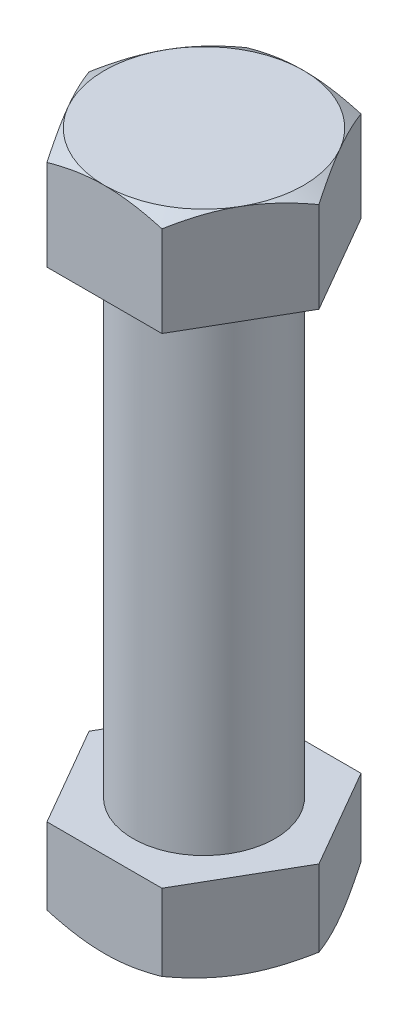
ISO-10303-21;
HEADER;
FILE_DESCRIPTION(('STEP AP214'),'2;1');
FILE_NAME('part.step','',(''),(''),'','','');
FILE_SCHEMA(('AUTOMOTIVE_DESIGN { 1 0 10303 214 1 1 1 1 }'));
ENDSEC;
DATA;
#1=APPLICATION_CONTEXT('core data for automotive mechanical design processes');
#2=APPLICATION_PROTOCOL_DEFINITION('international standard','automotive_design',2000,#1);
#3=PRODUCT_CONTEXT('',#1,'mechanical');
#4=PRODUCT('Part','Part','',(#3));
#5=PRODUCT_RELATED_PRODUCT_CATEGORY('part','',(#4));
#6=PRODUCT_DEFINITION_FORMATION('','',#4);
#7=PRODUCT_DEFINITION_CONTEXT('part definition',#1,'design');
#8=PRODUCT_DEFINITION('design','',#6,#7);
#9=PRODUCT_DEFINITION_SHAPE('','',#8);
#10=(LENGTH_UNIT() NAMED_UNIT(*) SI_UNIT(.MILLI.,.METRE.));
#11=(NAMED_UNIT(*) PLANE_ANGLE_UNIT() SI_UNIT($,.RADIAN.));
#12=(NAMED_UNIT(*) SI_UNIT($,.STERADIAN.) SOLID_ANGLE_UNIT());
#13=UNCERTAINTY_MEASURE_WITH_UNIT(LENGTH_MEASURE(1.E-05),#10,'distance_accuracy_value','');
#14=(GEOMETRIC_REPRESENTATION_CONTEXT(3) GLOBAL_UNCERTAINTY_ASSIGNED_CONTEXT((#13)) GLOBAL_UNIT_ASSIGNED_CONTEXT((#10,
#11,#12)) REPRESENTATION_CONTEXT('',''));
#15=CARTESIAN_POINT('',(0.,0.,0.));
#16=DIRECTION('',(0.,0.,1.));
#17=DIRECTION('',(1.,0.,0.));
#18=AXIS2_PLACEMENT_3D('',#15,#16,#17);
#19=CARTESIAN_POINT('',(-12.7,42.9,0.));
#20=DIRECTION('',(0.,-1.,0.));
#21=DIRECTION('',(0.,0.,1.));
#22=AXIS2_PLACEMENT_3D('',#19,#20,#21);
#23=PLANE('',#22);
#24=CARTESIAN_POINT('',(0.,42.9,0.));
#25=DIRECTION('',(0.,-1.,0.));
#26=DIRECTION('',(0.,0.,1.));
#27=AXIS2_PLACEMENT_3D('',#24,#25,#26);
#28=CIRCLE('',#27,12.7);
#29=CARTESIAN_POINT('',(0.,42.9,12.7));
#30=VERTEX_POINT('',#29);
#31=EDGE_CURVE('E360',#30,#30,#28,.T.);
#32=ORIENTED_EDGE('',*,*,#31,.F.);
#33=EDGE_LOOP('',(#32));
#34=FACE_BOUND('',#33,.T.);
#35=DIRECTION('',(-0.5,0.,-0.866025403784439));
#36=VECTOR('',#35,1.);
#37=CARTESIAN_POINT('',(-20.5305755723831,42.9,0.));
#38=LINE('',#37,#36);
#39=CARTESIAN_POINT('',(-10.2652877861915,42.9,17.78));
#40=VERTEX_POINT('',#39);
#41=CARTESIAN_POINT('',(-20.5305755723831,42.9,0.));
#42=VERTEX_POINT('',#41);
#43=EDGE_CURVE('E363',#40,#42,#38,.T.);
#44=ORIENTED_EDGE('',*,*,#43,.T.);
#45=DIRECTION('',(0.5,0.,-0.866025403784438));
#46=VECTOR('',#45,1.);
#47=CARTESIAN_POINT('',(-10.2652877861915,42.9,-17.78));
#48=LINE('',#47,#46);
#49=CARTESIAN_POINT('',(-10.2652877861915,42.9,-17.78));
#50=VERTEX_POINT('',#49);
#51=EDGE_CURVE('E179',#42,#50,#48,.T.);
#52=ORIENTED_EDGE('',*,*,#51,.T.);
#53=DIRECTION('',(1.,0.,0.));
#54=VECTOR('',#53,1.);
#55=CARTESIAN_POINT('',(10.2652877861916,42.9,-17.78));
#56=LINE('',#55,#54);
#57=CARTESIAN_POINT('',(10.2652877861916,42.9,-17.78));
#58=VERTEX_POINT('',#57);
#59=EDGE_CURVE('E174',#50,#58,#56,.T.);
#60=ORIENTED_EDGE('',*,*,#59,.T.);
#61=DIRECTION('',(0.5,0.,0.866025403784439));
#62=VECTOR('',#61,1.);
#63=CARTESIAN_POINT('',(20.5305755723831,42.9,0.));
#64=LINE('',#63,#62);
#65=CARTESIAN_POINT('',(20.5305755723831,42.9,0.));
#66=VERTEX_POINT('',#65);
#67=EDGE_CURVE('E191',#58,#66,#64,.T.);
#68=ORIENTED_EDGE('',*,*,#67,.T.);
#69=DIRECTION('',(-0.5,0.,0.866025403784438));
#70=VECTOR('',#69,1.);
#71=CARTESIAN_POINT('',(10.2652877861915,42.9,17.78));
#72=LINE('',#71,#70);
#73=CARTESIAN_POINT('',(10.2652877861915,42.9,17.78));
#74=VERTEX_POINT('',#73);
#75=EDGE_CURVE('E375',#66,#74,#72,.T.);
#76=ORIENTED_EDGE('',*,*,#75,.T.);
#77=DIRECTION('',(-1.,0.,0.));
#78=VECTOR('',#77,1.);
#79=CARTESIAN_POINT('',(-10.2652877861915,42.9,17.78));
#80=LINE('',#79,#78);
#81=EDGE_CURVE('E365',#74,#40,#80,.T.);
#82=ORIENTED_EDGE('',*,*,#81,.T.);
#83=EDGE_LOOP('',(#44,#52,#60,#68,#76,#82));
#84=FACE_BOUND('',#83,.T.);
#85=ADVANCED_FACE('F40',(#34,#84),#23,.T.);
#86=CARTESIAN_POINT('',(0.,59.0888803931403,0.));
#87=DIRECTION('',(0.,-1.,0.));
#88=DIRECTION('',(0.,0.,1.));
#89=AXIS2_PLACEMENT_3D('',#86,#87,#88);
#90=CONICAL_SURFACE('',#89,20.5359,1.0471975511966);
#91=CARTESIAN_POINT('',(27.2254823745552,52.1715890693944,-17.78));
#92=CARTESIAN_POINT('',(26.8351739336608,52.3602592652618,-17.78));
#93=CARTESIAN_POINT('',(26.444393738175,52.5479530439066,-17.78));
#94=CARTESIAN_POINT('',(25.6617901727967,52.921163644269,-17.78));
#95=CARTESIAN_POINT('',(25.2699667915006,53.1066804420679,-17.78));
#96=CARTESIAN_POINT('',(24.0926676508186,53.6596829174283,-17.78));
#97=CARTESIAN_POINT('',(23.3054897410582,54.023559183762,-17.78));
#98=CARTESIAN_POINT('',(21.7211901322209,54.7414195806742,-17.78));
#99=CARTESIAN_POINT('',(20.9240373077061,55.0953351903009,-17.78));
#100=CARTESIAN_POINT('',(19.323180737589,55.787971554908,-17.78));
#101=CARTESIAN_POINT('',(18.5194773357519,56.1266931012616,-17.78));
#102=CARTESIAN_POINT('',(16.8942623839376,56.7889133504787,-17.78));
#103=CARTESIAN_POINT('',(16.0726533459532,57.1121740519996,-17.78));
#104=CARTESIAN_POINT('',(14.4197388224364,57.7333799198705,-17.78));
#105=CARTESIAN_POINT('',(13.5884322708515,58.031322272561,-17.78));
#106=CARTESIAN_POINT('',(11.9165348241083,58.5938821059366,-17.78));
#107=CARTESIAN_POINT('',(11.075967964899,58.8585704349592,-17.78));
#108=CARTESIAN_POINT('',(9.38280321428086,59.3460394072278,-17.78));
#109=CARTESIAN_POINT('',(8.53020921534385,59.5688332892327,-17.78));
#110=CARTESIAN_POINT('',(7.24213587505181,59.8634476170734,-17.78));
#111=CARTESIAN_POINT('',(6.81115635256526,59.9550713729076,-17.78));
#112=CARTESIAN_POINT('',(5.94632881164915,60.1236799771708,-17.78));
#113=CARTESIAN_POINT('',(5.5124808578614,60.2006651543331,-17.78));
#114=CARTESIAN_POINT('',(4.64220759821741,60.3386317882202,-17.78));
#115=CARTESIAN_POINT('',(4.20578213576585,60.3996122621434,-17.78));
#116=CARTESIAN_POINT('',(3.33085390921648,60.5043446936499,-17.78));
#117=CARTESIAN_POINT('',(2.89235114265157,60.5480966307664,-17.78));
#118=CARTESIAN_POINT('',(2.01669172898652,60.6171941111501,-17.78));
#119=CARTESIAN_POINT('',(1.57954423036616,60.6426548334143,-17.78));
#120=CARTESIAN_POINT('',(0.704565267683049,60.6750360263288,-17.78));
#121=CARTESIAN_POINT('',(0.266733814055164,60.6819567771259,-17.78));
#122=CARTESIAN_POINT('',(-0.608706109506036,60.6770938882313,-17.78));
#123=CARTESIAN_POINT('',(-1.04631460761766,60.6653154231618,-17.78));
#124=CARTESIAN_POINT('',(-1.92064975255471,60.6233469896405,-17.78));
#125=CARTESIAN_POINT('',(-2.35737635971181,60.5931562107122,-17.78));
#126=CARTESIAN_POINT('',(-3.4155339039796,60.4983291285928,-17.78));
#127=CARTESIAN_POINT('',(-4.03615593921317,60.4244869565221,-17.78));
#128=CARTESIAN_POINT('',(-5.27253843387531,60.2437309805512,-17.78));
#129=CARTESIAN_POINT('',(-5.88829815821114,60.1368122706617,-17.78));
#130=CARTESIAN_POINT('',(-7.72935796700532,59.7718040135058,-17.78));
#131=CARTESIAN_POINT('',(-8.94603372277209,59.4697053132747,-17.78));
#132=CARTESIAN_POINT('',(-10.7659782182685,58.9487834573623,-17.78));
#133=CARTESIAN_POINT('',(-11.3787556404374,58.7612979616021,-17.78));
#134=CARTESIAN_POINT('',(-12.5983904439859,58.3676329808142,-17.78));
#135=CARTESIAN_POINT('',(-13.2052472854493,58.161451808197,-17.78));
#136=CARTESIAN_POINT('',(-14.410015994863,57.7347887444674,-17.78));
#137=CARTESIAN_POINT('',(-15.0079590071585,57.5143940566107,-17.78));
#138=CARTESIAN_POINT('',(-15.9011075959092,57.1742594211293,-17.78));
#139=CARTESIAN_POINT('',(-16.1981481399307,57.059310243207,-17.78));
#140=CARTESIAN_POINT('',(-16.7910752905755,56.8264891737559,-17.78));
#141=CARTESIAN_POINT('',(-17.0869619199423,56.7086173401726,-17.78));
#142=CARTESIAN_POINT('',(-17.382311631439,56.5894160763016,-17.78));
#143=B_SPLINE_CURVE_WITH_KNOTS('',3,(#91,#92,#93,#94,#95,#96,#97,#98,#99,#100,#101,#102,#103,
#104,#105,#106,#107,#108,#109,#110,#111,#112,#113,#114,#115,#116,#117,#118,#119,#120,#121,#122,
#123,#124,#125,#126,#127,#128,#129,#130,#131,#132,#133,#134,#135,#136,#137,#138,#139,#140,#141,
#142),.UNSPECIFIED.,.F.,.F.,(4,2,2,2,2,2,2,2,2,2,2,2,2,2,2,2,2,2,2,2,2,2,2,2,2,4),(0.,
1.30054892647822,2.6011121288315,5.20266140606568,7.81909755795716,10.43539727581,
13.0838236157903,15.732543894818,18.3755217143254,21.0176629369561,22.3392880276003,
23.6608834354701,24.9825599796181,26.3042380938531,27.6175189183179,28.930779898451,
30.2436775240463,31.5566329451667,33.4305669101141,35.3047789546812,39.0604224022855,
40.9827238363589,42.9051989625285,44.8168326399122,45.7723387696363,46.7278259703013),.UNSPECIFIED.);
#144=CARTESIAN_POINT('',(0.,60.68,-17.78));
#145=VERTEX_POINT('',#144);
#146=CARTESIAN_POINT('',(-10.2652877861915,59.0919544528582,-17.78));
#147=VERTEX_POINT('',#146);
#148=EDGE_CURVE('E171',#145,#147,#143,.T.);
#149=ORIENTED_EDGE('',*,*,#148,.T.);
#150=CARTESIAN_POINT('',(-10.265286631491,59.0919537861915,-17.780002));
#151=CARTESIAN_POINT('',(-10.4909124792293,59.2222078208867,-17.3892065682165));
#152=CARTESIAN_POINT('',(-10.7174183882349,59.3465509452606,-16.9968868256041));
#153=CARTESIAN_POINT('',(-11.1722465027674,59.5817723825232,-16.2091014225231));
#154=CARTESIAN_POINT('',(-11.4005692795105,59.6926462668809,-15.8136347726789));
#155=CARTESIAN_POINT('',(-11.859472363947,59.8994388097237,-15.0187913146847));
#156=CARTESIAN_POINT('',(-12.0900566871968,59.9953220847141,-14.6194075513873));
#157=CARTESIAN_POINT('',(-12.5528275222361,60.1700744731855,-13.8178649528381));
#158=CARTESIAN_POINT('',(-12.7850139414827,60.248944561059,-13.4157062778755));
#159=CARTESIAN_POINT('',(-13.2450396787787,60.3863160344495,-12.6189183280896));
#160=CARTESIAN_POINT('',(-13.4728448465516,60.4452721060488,-12.22434820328));
#161=CARTESIAN_POINT('',(-13.9294989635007,60.5441272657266,-11.4334000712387));
#162=CARTESIAN_POINT('',(-14.1583479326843,60.5840259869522,-11.0370220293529));
#163=CARTESIAN_POINT('',(-14.616430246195,60.6437590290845,-10.2436001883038));
#164=CARTESIAN_POINT('',(-14.8456628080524,60.6636171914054,-9.84655774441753));
#165=CARTESIAN_POINT('',(-15.3043394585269,60.6828420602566,-9.05210648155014));
#166=CARTESIAN_POINT('',(-15.5337835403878,60.6822094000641,-8.65469767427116));
#167=CARTESIAN_POINT('',(-15.9627271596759,60.6618844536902,-7.91174553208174));
#168=CARTESIAN_POINT('',(-16.162257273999,60.6446706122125,-7.56614923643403));
#169=CARTESIAN_POINT('',(-16.5608415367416,60.5950732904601,-6.87578104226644));
#170=CARTESIAN_POINT('',(-16.7598956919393,60.5626900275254,-6.5310091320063));
#171=CARTESIAN_POINT('',(-17.1574526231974,60.4833157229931,-5.84242032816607));
#172=CARTESIAN_POINT('',(-17.3559547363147,60.4363114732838,-5.49860458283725));
#173=CARTESIAN_POINT('',(-17.7520140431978,60.3285245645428,-4.81260974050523));
#174=CARTESIAN_POINT('',(-17.9495712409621,60.2677419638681,-4.47043063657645));
#175=CARTESIAN_POINT('',(-18.5492811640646,60.0631808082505,-3.43170257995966));
#176=CARTESIAN_POINT('',(-18.9496972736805,59.8990056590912,-2.73816153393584));
#177=CARTESIAN_POINT('',(-19.744559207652,59.5263964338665,-1.36142027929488));
#178=CARTESIAN_POINT('',(-20.1390152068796,59.3180498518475,-0.678202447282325));
#179=CARTESIAN_POINT('',(-20.5305767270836,59.0919537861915,1.99999999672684E-06));
#180=B_SPLINE_CURVE_WITH_KNOTS('',3,(#150,#151,#152,#153,#154,#155,#156,#157,#158,#159,#160,
#161,#162,#163,#164,#165,#166,#167,#168,#169,#170,#171,#172,#173,#174,#175,#176,#177,#178,#179),
.UNSPECIFIED.,.F.,.F.,(4,2,2,2,2,2,2,2,2,2,2,2,2,2,4),(0.,1.4090605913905,2.81858321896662,
4.23138419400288,5.6441042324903,7.02195607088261,8.39983443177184,9.77607164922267,
11.15226633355,12.3502714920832,13.5482594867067,14.7473328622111,15.9464011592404,
18.3973523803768,20.8434934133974),.UNSPECIFIED.);
#181=CARTESIAN_POINT('',(-15.3979316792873,60.68,-8.89));
#182=VERTEX_POINT('',#181);
#183=EDGE_CURVE('E182',#147,#182,#180,.T.);
#184=ORIENTED_EDGE('',*,*,#183,.T.);
#185=CARTESIAN_POINT('',(0.,60.68,0.));
#186=DIRECTION('',(0.,-1.,0.));
#187=DIRECTION('',(0.,0.,1.));
#188=AXIS2_PLACEMENT_3D('',#185,#186,#187);
#189=CIRCLE('',#188,17.78);
#190=EDGE_CURVE('E194',#182,#145,#189,.T.);
#191=ORIENTED_EDGE('',*,*,#190,.T.);
#192=EDGE_LOOP('',(#149,#184,#191));
#193=FACE_BOUND('',#192,.T.);
#194=ADVANCED_FACE('F193',(#193),#90,.T.);
#195=CARTESIAN_POINT('',(-15.3979316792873,60.68,8.89));
#196=VERTEX_POINT('',#195);
#197=EDGE_CURVE('E406',#196,#182,#189,.T.);
#198=ORIENTED_EDGE('',*,*,#197,.T.);
#199=CARTESIAN_POINT('',(-20.5305755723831,59.0919544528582,0.));
#200=VERTEX_POINT('',#199);
#201=EDGE_CURVE('E186',#182,#200,#180,.T.);
#202=ORIENTED_EDGE('',*,*,#201,.T.);
#203=CARTESIAN_POINT('',(-20.5305767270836,59.0919537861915,-2.00000000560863E-06));
#204=CARTESIAN_POINT('',(-20.3049508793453,59.2222078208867,0.390793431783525));
#205=CARTESIAN_POINT('',(-20.0784449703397,59.3465509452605,0.783113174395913));
#206=CARTESIAN_POINT('',(-19.6236168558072,59.5817723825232,1.57089857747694));
#207=CARTESIAN_POINT('',(-19.3952940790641,59.6926462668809,1.96636522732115));
#208=CARTESIAN_POINT('',(-18.9363909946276,59.8994388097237,2.76120868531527));
#209=CARTESIAN_POINT('',(-18.7058066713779,59.9953220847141,3.1605924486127));
#210=CARTESIAN_POINT('',(-18.2430358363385,60.1700744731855,3.96213504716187));
#211=CARTESIAN_POINT('',(-18.0108494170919,60.248944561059,4.36429372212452));
#212=CARTESIAN_POINT('',(-17.550823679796,60.3863160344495,5.16108167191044));
#213=CARTESIAN_POINT('',(-17.323018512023,60.4452721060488,5.55565179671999));
#214=CARTESIAN_POINT('',(-16.8663643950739,60.5441272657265,6.34659992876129));
#215=CARTESIAN_POINT('',(-16.6375154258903,60.5840259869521,6.74297797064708));
#216=CARTESIAN_POINT('',(-16.1794331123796,60.6437590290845,7.53639981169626));
#217=CARTESIAN_POINT('',(-15.9502005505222,60.6636171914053,7.93344225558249));
#218=CARTESIAN_POINT('',(-15.4915239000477,60.6828420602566,8.72789351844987));
#219=CARTESIAN_POINT('',(-15.2620798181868,60.6822094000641,9.12530232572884));
#220=CARTESIAN_POINT('',(-14.8331361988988,60.6618844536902,9.86825446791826));
#221=CARTESIAN_POINT('',(-14.6336060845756,60.6446706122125,10.213850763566));
#222=CARTESIAN_POINT('',(-14.235021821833,60.5950732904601,10.9042189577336));
#223=CARTESIAN_POINT('',(-14.0359676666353,60.5626900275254,11.2489908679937));
#224=CARTESIAN_POINT('',(-13.6384107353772,60.4833157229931,11.9375796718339));
#225=CARTESIAN_POINT('',(-13.43990862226,60.4363114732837,12.2813954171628));
#226=CARTESIAN_POINT('',(-13.0438493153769,60.3285245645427,12.9673902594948));
#227=CARTESIAN_POINT('',(-12.8462921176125,60.2677419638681,13.3095693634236));
#228=CARTESIAN_POINT('',(-12.24658219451,60.0631808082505,14.3482974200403));
#229=CARTESIAN_POINT('',(-11.8461660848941,59.8990056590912,15.0418384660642));
#230=CARTESIAN_POINT('',(-11.0513041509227,59.5263964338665,16.4185797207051));
#231=CARTESIAN_POINT('',(-10.6568481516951,59.3180498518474,17.1017975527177));
#232=CARTESIAN_POINT('',(-10.265286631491,59.0919537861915,17.780002));
#233=B_SPLINE_CURVE_WITH_KNOTS('',3,(#203,#204,#205,#206,#207,#208,#209,#210,#211,#212,#213,
#214,#215,#216,#217,#218,#219,#220,#221,#222,#223,#224,#225,#226,#227,#228,#229,#230,#231,#232),
.UNSPECIFIED.,.F.,.F.,(4,2,2,2,2,2,2,2,2,2,2,2,2,2,4),(0.,1.4090605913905,2.81858321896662,
4.23138419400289,5.64410423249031,7.02195607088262,8.39983443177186,9.77607164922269,
11.15226633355,12.3502714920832,13.5482594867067,14.7473328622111,15.9464011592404,
18.3973523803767,20.8434934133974),.UNSPECIFIED.);
#234=EDGE_CURVE('E259',#200,#196,#233,.T.);
#235=ORIENTED_EDGE('',*,*,#234,.T.);
#236=EDGE_LOOP('',(#198,#202,#235));
#237=FACE_BOUND('',#236,.T.);
#238=ADVANCED_FACE('F221',(#237),#90,.T.);
#239=CARTESIAN_POINT('',(0.,60.68,17.78));
#240=VERTEX_POINT('',#239);
#241=EDGE_CURVE('E401',#240,#196,#189,.T.);
#242=ORIENTED_EDGE('',*,*,#241,.T.);
#243=CARTESIAN_POINT('',(-10.2652877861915,59.0919544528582,17.78));
#244=VERTEX_POINT('',#243);
#245=EDGE_CURVE('E251',#196,#244,#233,.T.);
#246=ORIENTED_EDGE('',*,*,#245,.T.);
#247=CARTESIAN_POINT('',(27.2254823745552,52.1715890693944,17.78));
#248=CARTESIAN_POINT('',(26.8351739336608,52.3602592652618,17.78));
#249=CARTESIAN_POINT('',(26.444393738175,52.5479530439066,17.78));
#250=CARTESIAN_POINT('',(25.6617901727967,52.921163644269,17.78));
#251=CARTESIAN_POINT('',(25.2699667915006,53.1066804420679,17.78));
#252=CARTESIAN_POINT('',(24.0926676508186,53.6596829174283,17.78));
#253=CARTESIAN_POINT('',(23.3054897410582,54.023559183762,17.78));
#254=CARTESIAN_POINT('',(21.7211901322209,54.7414195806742,17.78));
#255=CARTESIAN_POINT('',(20.9240373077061,55.0953351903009,17.78));
#256=CARTESIAN_POINT('',(19.323180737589,55.787971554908,17.78));
#257=CARTESIAN_POINT('',(18.5194773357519,56.1266931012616,17.78));
#258=CARTESIAN_POINT('',(16.8942623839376,56.7889133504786,17.78));
#259=CARTESIAN_POINT('',(16.0726533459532,57.1121740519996,17.78));
#260=CARTESIAN_POINT('',(14.4197388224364,57.7333799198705,17.78));
#261=CARTESIAN_POINT('',(13.5884322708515,58.031322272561,17.78));
#262=CARTESIAN_POINT('',(11.9165348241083,58.5938821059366,17.78));
#263=CARTESIAN_POINT('',(11.075967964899,58.8585704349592,17.78));
#264=CARTESIAN_POINT('',(9.38280321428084,59.3460394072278,17.78));
#265=CARTESIAN_POINT('',(8.53020921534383,59.5688332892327,17.78));
#266=CARTESIAN_POINT('',(7.24213587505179,59.8634476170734,17.78));
#267=CARTESIAN_POINT('',(6.81115635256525,59.9550713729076,17.78));
#268=CARTESIAN_POINT('',(5.94632881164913,60.1236799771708,17.78));
#269=CARTESIAN_POINT('',(5.51248085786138,60.2006651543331,17.78));
#270=CARTESIAN_POINT('',(4.64220759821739,60.3386317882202,17.78));
#271=CARTESIAN_POINT('',(4.20578213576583,60.3996122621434,17.78));
#272=CARTESIAN_POINT('',(3.33085390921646,60.5043446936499,17.78));
#273=CARTESIAN_POINT('',(2.89235114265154,60.5480966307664,17.78));
#274=CARTESIAN_POINT('',(2.0166917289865,60.6171941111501,17.78));
#275=CARTESIAN_POINT('',(1.57954423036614,60.6426548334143,17.78));
#276=CARTESIAN_POINT('',(0.704565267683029,60.6750360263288,17.78));
#277=CARTESIAN_POINT('',(0.266733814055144,60.6819567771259,17.78));
#278=CARTESIAN_POINT('',(-0.608706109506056,60.6770938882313,17.78));
#279=CARTESIAN_POINT('',(-1.04631460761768,60.6653154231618,17.78));
#280=CARTESIAN_POINT('',(-1.92064975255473,60.6233469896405,17.78));
#281=CARTESIAN_POINT('',(-2.35737635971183,60.5931562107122,17.78));
#282=CARTESIAN_POINT('',(-3.41553390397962,60.4983291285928,17.78));
#283=CARTESIAN_POINT('',(-4.03615593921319,60.4244869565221,17.78));
#284=CARTESIAN_POINT('',(-5.27253843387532,60.2437309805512,17.78));
#285=CARTESIAN_POINT('',(-5.88829815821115,60.1368122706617,17.78));
#286=CARTESIAN_POINT('',(-7.72935796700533,59.7718040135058,17.78));
#287=CARTESIAN_POINT('',(-8.9460337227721,59.4697053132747,17.78));
#288=CARTESIAN_POINT('',(-10.7659782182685,58.9487834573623,17.78));
#289=CARTESIAN_POINT('',(-11.3787556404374,58.7612979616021,17.78));
#290=CARTESIAN_POINT('',(-12.5983904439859,58.3676329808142,17.78));
#291=CARTESIAN_POINT('',(-13.2052472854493,58.161451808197,17.78));
#292=CARTESIAN_POINT('',(-14.410015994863,57.7347887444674,17.78));
#293=CARTESIAN_POINT('',(-15.0079590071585,57.5143940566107,17.78));
#294=CARTESIAN_POINT('',(-15.9011075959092,57.1742594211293,17.78));
#295=CARTESIAN_POINT('',(-16.1981481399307,57.059310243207,17.78));
#296=CARTESIAN_POINT('',(-16.7910752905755,56.8264891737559,17.78));
#297=CARTESIAN_POINT('',(-17.0869619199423,56.7086173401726,17.78));
#298=CARTESIAN_POINT('',(-17.382311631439,56.5894160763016,17.78));
#299=B_SPLINE_CURVE_WITH_KNOTS('',3,(#247,#248,#249,#250,#251,#252,#253,#254,#255,#256,#257,
#258,#259,#260,#261,#262,#263,#264,#265,#266,#267,#268,#269,#270,#271,#272,#273,#274,#275,#276,
#277,#278,#279,#280,#281,#282,#283,#284,#285,#286,#287,#288,#289,#290,#291,#292,#293,#294,#295,
#296,#297,#298),.UNSPECIFIED.,.F.,.F.,(4,2,2,2,2,2,2,2,2,2,2,2,2,2,2,2,2,2,2,2,2,2,2,2,2,4),(0.,
1.30054892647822,2.6011121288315,5.20266140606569,7.81909755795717,10.43539727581,
13.0838236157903,15.732543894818,18.3755217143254,21.0176629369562,22.3392880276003,
23.6608834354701,24.9825599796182,26.3042380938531,27.6175189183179,28.930779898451,
30.2436775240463,31.5566329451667,33.4305669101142,35.3047789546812,39.0604224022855,
40.9827238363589,42.9051989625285,44.8168326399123,45.7723387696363,46.7278259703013),.UNSPECIFIED.);
#300=EDGE_CURVE('E260',#244,#240,#299,.F.);
#301=ORIENTED_EDGE('',*,*,#300,.T.);
#302=EDGE_LOOP('',(#242,#246,#301));
#303=FACE_BOUND('',#302,.T.);
#304=ADVANCED_FACE('F398',(#303),#90,.T.);
#305=CARTESIAN_POINT('',(15.3979316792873,60.68,8.89));
#306=VERTEX_POINT('',#305);
#307=EDGE_CURVE('E408',#306,#240,#189,.T.);
#308=ORIENTED_EDGE('',*,*,#307,.T.);
#309=CARTESIAN_POINT('',(10.2652877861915,59.0919544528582,17.78));
#310=VERTEX_POINT('',#309);
#311=EDGE_CURVE('E244',#240,#310,#299,.F.);
#312=ORIENTED_EDGE('',*,*,#311,.T.);
#313=CARTESIAN_POINT('',(10.265286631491,59.0919537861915,17.780002));
#314=CARTESIAN_POINT('',(10.4909124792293,59.2222078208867,17.3892065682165));
#315=CARTESIAN_POINT('',(10.717418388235,59.3465509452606,16.9968868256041));
#316=CARTESIAN_POINT('',(11.1722465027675,59.5817723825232,16.2091014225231));
#317=CARTESIAN_POINT('',(11.4005692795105,59.6926462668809,15.8136347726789));
#318=CARTESIAN_POINT('',(11.859472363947,59.8994388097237,15.0187913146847));
#319=CARTESIAN_POINT('',(12.0900566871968,59.9953220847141,14.6194075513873));
#320=CARTESIAN_POINT('',(12.5528275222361,60.1700744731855,13.8178649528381));
#321=CARTESIAN_POINT('',(12.7850139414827,60.248944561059,13.4157062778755));
#322=CARTESIAN_POINT('',(13.2450396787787,60.3863160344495,12.6189183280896));
#323=CARTESIAN_POINT('',(13.4728448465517,60.4452721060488,12.22434820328));
#324=CARTESIAN_POINT('',(13.9294989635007,60.5441272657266,11.4334000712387));
#325=CARTESIAN_POINT('',(14.1583479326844,60.5840259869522,11.0370220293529));
#326=CARTESIAN_POINT('',(14.616430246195,60.6437590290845,10.2436001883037));
#327=CARTESIAN_POINT('',(14.8456628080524,60.6636171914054,9.84655774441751));
#328=CARTESIAN_POINT('',(15.304339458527,60.6828420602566,9.05210648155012));
#329=CARTESIAN_POINT('',(15.5337835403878,60.6822094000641,8.65469767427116));
#330=CARTESIAN_POINT('',(15.9627271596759,60.6618844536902,7.91174553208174));
#331=CARTESIAN_POINT('',(16.162257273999,60.6446706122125,7.56614923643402));
#332=CARTESIAN_POINT('',(16.5608415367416,60.5950732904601,6.87578104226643));
#333=CARTESIAN_POINT('',(16.7598956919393,60.5626900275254,6.5310091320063));
#334=CARTESIAN_POINT('',(17.1574526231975,60.4833157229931,5.84242032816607));
#335=CARTESIAN_POINT('',(17.3559547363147,60.4363114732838,5.49860458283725));
#336=CARTESIAN_POINT('',(17.7520140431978,60.3285245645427,4.81260974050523));
#337=CARTESIAN_POINT('',(17.9495712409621,60.2677419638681,4.47043063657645));
#338=CARTESIAN_POINT('',(18.5492811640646,60.0631808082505,3.43170257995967));
#339=CARTESIAN_POINT('',(18.9496972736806,59.8990056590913,2.73816153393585));
#340=CARTESIAN_POINT('',(19.744559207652,59.5263964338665,1.36142027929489));
#341=CARTESIAN_POINT('',(20.1390152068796,59.3180498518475,0.678202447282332));
#342=CARTESIAN_POINT('',(20.5305767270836,59.0919537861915,-1.99999998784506E-06));
#343=B_SPLINE_CURVE_WITH_KNOTS('',3,(#313,#314,#315,#316,#317,#318,#319,#320,#321,#322,#323,
#324,#325,#326,#327,#328,#329,#330,#331,#332,#333,#334,#335,#336,#337,#338,#339,#340,#341,#342),
.UNSPECIFIED.,.F.,.F.,(4,2,2,2,2,2,2,2,2,2,2,2,2,2,4),(0.,1.4090605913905,2.81858321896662,
4.23138419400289,5.64410423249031,7.02195607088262,8.39983443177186,9.77607164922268,
11.15226633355,12.3502714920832,13.5482594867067,14.7473328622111,15.9464011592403,
18.3973523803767,20.8434934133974),.UNSPECIFIED.);
#344=EDGE_CURVE('E608',#310,#306,#343,.T.);
#345=ORIENTED_EDGE('',*,*,#344,.T.);
#346=EDGE_LOOP('',(#308,#312,#345));
#347=FACE_BOUND('',#346,.T.);
#348=ADVANCED_FACE('F459',(#347),#90,.T.);
#349=CARTESIAN_POINT('',(15.3979316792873,60.68,-8.89));
#350=VERTEX_POINT('',#349);
#351=EDGE_CURVE('E414',#350,#306,#189,.T.);
#352=ORIENTED_EDGE('',*,*,#351,.T.);
#353=CARTESIAN_POINT('',(20.5305755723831,59.0919544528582,0.));
#354=VERTEX_POINT('',#353);
#355=EDGE_CURVE('E237',#306,#354,#343,.T.);
#356=ORIENTED_EDGE('',*,*,#355,.T.);
#357=CARTESIAN_POINT('',(20.5305767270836,59.0919537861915,2.00000000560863E-06));
#358=CARTESIAN_POINT('',(20.3049508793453,59.2222078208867,-0.390793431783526));
#359=CARTESIAN_POINT('',(20.0784449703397,59.3465509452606,-0.783113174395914));
#360=CARTESIAN_POINT('',(19.6236168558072,59.5817723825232,-1.57089857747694));
#361=CARTESIAN_POINT('',(19.3952940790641,59.6926462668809,-1.96636522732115));
#362=CARTESIAN_POINT('',(18.9363909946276,59.8994388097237,-2.76120868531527));
#363=CARTESIAN_POINT('',(18.7058066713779,59.9953220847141,-3.1605924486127));
#364=CARTESIAN_POINT('',(18.2430358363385,60.1700744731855,-3.96213504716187));
#365=CARTESIAN_POINT('',(18.0108494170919,60.248944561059,-4.36429372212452));
#366=CARTESIAN_POINT('',(17.550823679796,60.3863160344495,-5.16108167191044));
#367=CARTESIAN_POINT('',(17.323018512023,60.4452721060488,-5.55565179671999));
#368=CARTESIAN_POINT('',(16.8663643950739,60.5441272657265,-6.34659992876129));
#369=CARTESIAN_POINT('',(16.6375154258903,60.5840259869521,-6.74297797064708));
#370=CARTESIAN_POINT('',(16.1794331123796,60.6437590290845,-7.53639981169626));
#371=CARTESIAN_POINT('',(15.9502005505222,60.6636171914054,-7.93344225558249));
#372=CARTESIAN_POINT('',(15.4915239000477,60.6828420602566,-8.72789351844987));
#373=CARTESIAN_POINT('',(15.2620798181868,60.6822094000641,-9.12530232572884));
#374=CARTESIAN_POINT('',(14.8331361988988,60.6618844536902,-9.86825446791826));
#375=CARTESIAN_POINT('',(14.6336060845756,60.6446706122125,-10.213850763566));
#376=CARTESIAN_POINT('',(14.235021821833,60.5950732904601,-10.9042189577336));
#377=CARTESIAN_POINT('',(14.0359676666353,60.5626900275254,-11.2489908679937));
#378=CARTESIAN_POINT('',(13.6384107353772,60.4833157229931,-11.9375796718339));
#379=CARTESIAN_POINT('',(13.43990862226,60.4363114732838,-12.2813954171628));
#380=CARTESIAN_POINT('',(13.0438493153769,60.3285245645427,-12.9673902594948));
#381=CARTESIAN_POINT('',(12.8462921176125,60.2677419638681,-13.3095693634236));
#382=CARTESIAN_POINT('',(12.24658219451,60.0631808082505,-14.3482974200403));
#383=CARTESIAN_POINT('',(11.8461660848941,59.8990056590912,-15.0418384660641));
#384=CARTESIAN_POINT('',(11.0513041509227,59.5263964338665,-16.4185797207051));
#385=CARTESIAN_POINT('',(10.6568481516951,59.3180498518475,-17.1017975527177));
#386=CARTESIAN_POINT('',(10.265286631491,59.0919537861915,-17.780002));
#387=B_SPLINE_CURVE_WITH_KNOTS('',3,(#357,#358,#359,#360,#361,#362,#363,#364,#365,#366,#367,
#368,#369,#370,#371,#372,#373,#374,#375,#376,#377,#378,#379,#380,#381,#382,#383,#384,#385,#386),
.UNSPECIFIED.,.F.,.F.,(4,2,2,2,2,2,2,2,2,2,2,2,2,2,4),(0.,1.4090605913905,2.81858321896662,
4.23138419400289,5.64410423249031,7.02195607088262,8.39983443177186,9.77607164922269,
11.15226633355,12.3502714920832,13.5482594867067,14.7473328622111,15.9464011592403,
18.3973523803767,20.8434934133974),.UNSPECIFIED.);
#388=EDGE_CURVE('E605',#354,#350,#387,.T.);
#389=ORIENTED_EDGE('',*,*,#388,.T.);
#390=EDGE_LOOP('',(#352,#356,#389));
#391=FACE_BOUND('',#390,.T.);
#392=ADVANCED_FACE('F481',(#391),#90,.T.);
#393=EDGE_CURVE('E423',#145,#350,#189,.T.);
#394=ORIENTED_EDGE('',*,*,#393,.T.);
#395=CARTESIAN_POINT('',(10.2652877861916,59.0919544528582,-17.78));
#396=VERTEX_POINT('',#395);
#397=EDGE_CURVE('E229',#350,#396,#387,.T.);
#398=ORIENTED_EDGE('',*,*,#397,.T.);
#399=EDGE_CURVE('E196',#396,#145,#143,.T.);
#400=ORIENTED_EDGE('',*,*,#399,.T.);
#401=EDGE_LOOP('',(#394,#398,#400));
#402=FACE_BOUND('',#401,.T.);
#403=ADVANCED_FACE('F222',(#402),#90,.T.);
#404=CARTESIAN_POINT('',(-17.78,60.68,0.));
#405=DIRECTION('',(0.,1.,0.));
#406=DIRECTION('',(0.,0.,-1.));
#407=AXIS2_PLACEMENT_3D('',#404,#405,#406);
#408=PLANE('',#407);
#409=ORIENTED_EDGE('',*,*,#241,.F.);
#410=ORIENTED_EDGE('',*,*,#307,.F.);
#411=ORIENTED_EDGE('',*,*,#351,.F.);
#412=ORIENTED_EDGE('',*,*,#393,.F.);
#413=ORIENTED_EDGE('',*,*,#190,.F.);
#414=ORIENTED_EDGE('',*,*,#197,.F.);
#415=EDGE_LOOP('',(#409,#410,#411,#412,#413,#414));
#416=FACE_BOUND('',#415,.T.);
#417=ADVANCED_FACE('F223',(#416),#408,.T.);
#418=CARTESIAN_POINT('',(-10.2652877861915,61.68,-17.78));
#419=DIRECTION('',(0.866025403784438,0.,0.5));
#420=DIRECTION('',(0.5,0.,-0.866025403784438));
#421=AXIS2_PLACEMENT_3D('',#418,#419,#420);
#422=PLANE('',#421);
#423=ORIENTED_EDGE('',*,*,#51,.F.);
#424=DIRECTION('',(0.,-1.,0.));
#425=VECTOR('',#424,1.);
#426=CARTESIAN_POINT('',(-20.5305755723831,61.68,0.));
#427=LINE('',#426,#425);
#428=EDGE_CURVE('E197',#200,#42,#427,.T.);
#429=ORIENTED_EDGE('',*,*,#428,.F.);
#430=ORIENTED_EDGE('',*,*,#201,.F.);
#431=ORIENTED_EDGE('',*,*,#183,.F.);
#432=DIRECTION('',(0.,-1.,0.));
#433=VECTOR('',#432,1.);
#434=CARTESIAN_POINT('',(-10.2652877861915,61.68,-17.78));
#435=LINE('',#434,#433);
#436=EDGE_CURVE('E167',#147,#50,#435,.T.);
#437=ORIENTED_EDGE('',*,*,#436,.T.);
#438=EDGE_LOOP('',(#423,#429,#430,#431,#437));
#439=FACE_BOUND('',#438,.T.);
#440=ADVANCED_FACE('F183',(#439),#422,.F.);
#441=CARTESIAN_POINT('',(-20.5305755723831,61.68,0.));
#442=DIRECTION('',(0.866025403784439,0.,-0.5));
#443=DIRECTION('',(-0.5,0.,-0.866025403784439));
#444=AXIS2_PLACEMENT_3D('',#441,#442,#443);
#445=PLANE('',#444);
#446=ORIENTED_EDGE('',*,*,#43,.F.);
#447=DIRECTION('',(0.,-1.,0.));
#448=VECTOR('',#447,1.);
#449=CARTESIAN_POINT('',(-10.2652877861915,61.68,17.78));
#450=LINE('',#449,#448);
#451=EDGE_CURVE('E204',#244,#40,#450,.T.);
#452=ORIENTED_EDGE('',*,*,#451,.F.);
#453=ORIENTED_EDGE('',*,*,#245,.F.);
#454=ORIENTED_EDGE('',*,*,#234,.F.);
#455=ORIENTED_EDGE('',*,*,#428,.T.);
#456=EDGE_LOOP('',(#446,#452,#453,#454,#455));
#457=FACE_BOUND('',#456,.T.);
#458=ADVANCED_FACE('F267',(#457),#445,.F.);
#459=CARTESIAN_POINT('',(-10.2652877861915,61.68,17.78));
#460=DIRECTION('',(0.,0.,-1.));
#461=DIRECTION('',(-1.,0.,0.));
#462=AXIS2_PLACEMENT_3D('',#459,#460,#461);
#463=PLANE('',#462);
#464=ORIENTED_EDGE('',*,*,#81,.F.);
#465=DIRECTION('',(0.,-1.,0.));
#466=VECTOR('',#465,1.);
#467=CARTESIAN_POINT('',(10.2652877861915,61.68,17.78));
#468=LINE('',#467,#466);
#469=EDGE_CURVE('E385',#310,#74,#468,.T.);
#470=ORIENTED_EDGE('',*,*,#469,.F.);
#471=ORIENTED_EDGE('',*,*,#311,.F.);
#472=ORIENTED_EDGE('',*,*,#300,.F.);
#473=ORIENTED_EDGE('',*,*,#451,.T.);
#474=EDGE_LOOP('',(#464,#470,#471,#472,#473));
#475=FACE_BOUND('',#474,.T.);
#476=ADVANCED_FACE('F270',(#475),#463,.F.);
#477=CARTESIAN_POINT('',(10.2652877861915,61.68,17.78));
#478=DIRECTION('',(-0.866025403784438,0.,-0.5));
#479=DIRECTION('',(-0.5,0.,0.866025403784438));
#480=AXIS2_PLACEMENT_3D('',#477,#478,#479);
#481=PLANE('',#480);
#482=ORIENTED_EDGE('',*,*,#75,.F.);
#483=DIRECTION('',(0.,-1.,0.));
#484=VECTOR('',#483,1.);
#485=CARTESIAN_POINT('',(20.5305755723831,61.68,0.));
#486=LINE('',#485,#484);
#487=EDGE_CURVE('E381',#354,#66,#486,.T.);
#488=ORIENTED_EDGE('',*,*,#487,.F.);
#489=ORIENTED_EDGE('',*,*,#355,.F.);
#490=ORIENTED_EDGE('',*,*,#344,.F.);
#491=ORIENTED_EDGE('',*,*,#469,.T.);
#492=EDGE_LOOP('',(#482,#488,#489,#490,#491));
#493=FACE_BOUND('',#492,.T.);
#494=ADVANCED_FACE('F507',(#493),#481,.F.);
#495=CARTESIAN_POINT('',(20.5305755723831,61.68,0.));
#496=DIRECTION('',(-0.866025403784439,0.,0.5));
#497=DIRECTION('',(0.5,0.,0.866025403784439));
#498=AXIS2_PLACEMENT_3D('',#495,#496,#497);
#499=PLANE('',#498);
#500=ORIENTED_EDGE('',*,*,#67,.F.);
#501=DIRECTION('',(0.,-1.,0.));
#502=VECTOR('',#501,1.);
#503=CARTESIAN_POINT('',(10.2652877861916,61.68,-17.78));
#504=LINE('',#503,#502);
#505=EDGE_CURVE('E178',#396,#58,#504,.T.);
#506=ORIENTED_EDGE('',*,*,#505,.F.);
#507=ORIENTED_EDGE('',*,*,#397,.F.);
#508=ORIENTED_EDGE('',*,*,#388,.F.);
#509=ORIENTED_EDGE('',*,*,#487,.T.);
#510=EDGE_LOOP('',(#500,#506,#507,#508,#509));
#511=FACE_BOUND('',#510,.T.);
#512=ADVANCED_FACE('F517',(#511),#499,.F.);
#513=CARTESIAN_POINT('',(10.2652877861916,61.68,-17.78));
#514=DIRECTION('',(0.,0.,1.));
#515=DIRECTION('',(1.,0.,0.));
#516=AXIS2_PLACEMENT_3D('',#513,#514,#515);
#517=PLANE('',#516);
#518=ORIENTED_EDGE('',*,*,#59,.F.);
#519=ORIENTED_EDGE('',*,*,#436,.F.);
#520=ORIENTED_EDGE('',*,*,#148,.F.);
#521=ORIENTED_EDGE('',*,*,#399,.F.);
#522=ORIENTED_EDGE('',*,*,#505,.T.);
#523=EDGE_LOOP('',(#518,#519,#520,#521,#522));
#524=FACE_BOUND('',#523,.T.);
#525=ADVANCED_FACE('F169',(#524),#517,.F.);
#526=CARTESIAN_POINT('',(20.5305755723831,-58.14,0.));
#527=DIRECTION('',(0.,-1.,0.));
#528=DIRECTION('',(0.,0.,-1.));
#529=AXIS2_PLACEMENT_3D('',#526,#527,#528);
#530=PLANE('',#529);
#531=CARTESIAN_POINT('',(0.,-58.14,0.));
#532=DIRECTION('',(0.,-1.,0.));
#533=DIRECTION('',(0.,0.,-1.));
#534=AXIS2_PLACEMENT_3D('',#531,#532,#533);
#535=CIRCLE('',#534,17.78);
#536=CARTESIAN_POINT('',(-15.3979316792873,-58.14,-8.89));
#537=VERTEX_POINT('',#536);
#538=CARTESIAN_POINT('',(0.,-58.14,-17.78));
#539=VERTEX_POINT('',#538);
#540=EDGE_CURVE('E688',#537,#539,#535,.T.);
#541=ORIENTED_EDGE('',*,*,#540,.T.);
#542=CARTESIAN_POINT('',(15.3979316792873,-58.14,-8.89));
#543=VERTEX_POINT('',#542);
#544=EDGE_CURVE('E49',#539,#543,#535,.T.);
#545=ORIENTED_EDGE('',*,*,#544,.T.);
#546=CARTESIAN_POINT('',(15.3979316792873,-58.14,8.89));
#547=VERTEX_POINT('',#546);
#548=EDGE_CURVE('E679',#543,#547,#535,.T.);
#549=ORIENTED_EDGE('',*,*,#548,.T.);
#550=CARTESIAN_POINT('',(0.,-58.14,0.));
#551=DIRECTION('',(0.,1.,0.));
#552=DIRECTION('',(0.,0.,1.));
#553=AXIS2_PLACEMENT_3D('',#550,#551,#552);
#554=CIRCLE('',#553,17.78);
#555=CARTESIAN_POINT('',(0.,-58.14,17.78));
#556=VERTEX_POINT('',#555);
#557=EDGE_CURVE('E628',#556,#547,#554,.T.);
#558=ORIENTED_EDGE('',*,*,#557,.F.);
#559=CARTESIAN_POINT('',(-15.3979316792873,-58.14,8.89));
#560=VERTEX_POINT('',#559);
#561=EDGE_CURVE('E677',#556,#560,#535,.T.);
#562=ORIENTED_EDGE('',*,*,#561,.T.);
#563=EDGE_CURVE('E680',#560,#537,#535,.T.);
#564=ORIENTED_EDGE('',*,*,#563,.T.);
#565=EDGE_LOOP('',(#541,#545,#549,#558,#562,#564));
#566=FACE_BOUND('',#565,.T.);
#567=ADVANCED_FACE('F536',(#566),#530,.T.);
#568=CARTESIAN_POINT('',(0.,-56.5488803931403,0.));
#569=DIRECTION('',(0.,1.,0.));
#570=DIRECTION('',(0.,0.,1.));
#571=AXIS2_PLACEMENT_3D('',#568,#569,#570);
#572=CONICAL_SURFACE('',#571,20.5359,1.0471975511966);
#573=ORIENTED_EDGE('',*,*,#557,.T.);
#574=CARTESIAN_POINT('',(20.5305767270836,-56.5519537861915,-2.00000000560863E-06));
#575=CARTESIAN_POINT('',(20.3049508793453,-56.6822078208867,0.390793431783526));
#576=CARTESIAN_POINT('',(20.0784449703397,-56.8065509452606,0.783113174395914));
#577=CARTESIAN_POINT('',(19.6236168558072,-57.0417723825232,1.57089857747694));
#578=CARTESIAN_POINT('',(19.3952940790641,-57.1526462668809,1.96636522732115));
#579=CARTESIAN_POINT('',(18.9363909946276,-57.3594388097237,2.76120868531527));
#580=CARTESIAN_POINT('',(18.7058066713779,-57.4553220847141,3.1605924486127));
#581=CARTESIAN_POINT('',(18.2430358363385,-57.6300744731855,3.96213504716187));
#582=CARTESIAN_POINT('',(18.0108494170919,-57.708944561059,4.36429372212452));
#583=CARTESIAN_POINT('',(17.550823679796,-57.8463160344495,5.16108167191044));
#584=CARTESIAN_POINT('',(17.323018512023,-57.9052721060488,5.55565179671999));
#585=CARTESIAN_POINT('',(16.8663643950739,-58.0041272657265,6.3465999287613));
#586=CARTESIAN_POINT('',(16.6375154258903,-58.0440259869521,6.74297797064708));
#587=CARTESIAN_POINT('',(16.1794331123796,-58.1037590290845,7.53639981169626));
#588=CARTESIAN_POINT('',(15.9502005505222,-58.1236171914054,7.93344225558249));
#589=CARTESIAN_POINT('',(15.4915239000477,-58.1428420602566,8.72789351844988));
#590=CARTESIAN_POINT('',(15.2620798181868,-58.1422094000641,9.12530232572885));
#591=CARTESIAN_POINT('',(14.8331361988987,-58.1218844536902,9.86825446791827));
#592=CARTESIAN_POINT('',(14.6336060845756,-58.1046706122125,10.213850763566));
#593=CARTESIAN_POINT('',(14.235021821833,-58.0550732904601,10.9042189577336));
#594=CARTESIAN_POINT('',(14.0359676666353,-58.0226900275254,11.2489908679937));
#595=CARTESIAN_POINT('',(13.6384107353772,-57.9433157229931,11.9375796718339));
#596=CARTESIAN_POINT('',(13.4399086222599,-57.8963114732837,12.2813954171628));
#597=CARTESIAN_POINT('',(13.0438493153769,-57.7885245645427,12.9673902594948));
#598=CARTESIAN_POINT('',(12.8462921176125,-57.7277419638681,13.3095693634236));
#599=CARTESIAN_POINT('',(12.24658219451,-57.5231808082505,14.3482974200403));
#600=CARTESIAN_POINT('',(11.8461660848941,-57.3590056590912,15.0418384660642));
#601=CARTESIAN_POINT('',(11.0513041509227,-56.9863964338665,16.4185797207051));
#602=CARTESIAN_POINT('',(10.6568481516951,-56.7780498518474,17.1017975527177));
#603=CARTESIAN_POINT('',(10.265286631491,-56.5519537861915,17.780002));
#604=B_SPLINE_CURVE_WITH_KNOTS('',3,(#574,#575,#576,#577,#578,#579,#580,#581,#582,#583,#584,
#585,#586,#587,#588,#589,#590,#591,#592,#593,#594,#595,#596,#597,#598,#599,#600,#601,#602,#603),
.UNSPECIFIED.,.F.,.F.,(4,2,2,2,2,2,2,2,2,2,2,2,2,2,4),(0.,1.4090605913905,2.81858321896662,
4.23138419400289,5.64410423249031,7.02195607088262,8.39983443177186,9.77607164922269,
11.15226633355,12.3502714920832,13.5482594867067,14.7473328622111,15.9464011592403,
18.3973523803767,20.8434934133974),.UNSPECIFIED.);
#605=CARTESIAN_POINT('',(10.2652877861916,-56.5519544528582,17.78));
#606=VERTEX_POINT('',#605);
#607=EDGE_CURVE('E319',#547,#606,#604,.T.);
#608=ORIENTED_EDGE('',*,*,#607,.T.);
#609=CARTESIAN_POINT('',(-27.2254823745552,-49.6315890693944,17.78));
#610=CARTESIAN_POINT('',(-26.8351739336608,-49.8202592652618,17.78));
#611=CARTESIAN_POINT('',(-26.444393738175,-50.0079530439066,17.78));
#612=CARTESIAN_POINT('',(-25.6617901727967,-50.381163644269,17.78));
#613=CARTESIAN_POINT('',(-25.2699667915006,-50.5666804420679,17.78));
#614=CARTESIAN_POINT('',(-24.0926676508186,-51.1196829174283,17.78));
#615=CARTESIAN_POINT('',(-23.3054897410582,-51.483559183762,17.78));
#616=CARTESIAN_POINT('',(-21.7211901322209,-52.2014195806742,17.78));
#617=CARTESIAN_POINT('',(-20.9240373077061,-52.5553351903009,17.78));
#618=CARTESIAN_POINT('',(-19.323180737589,-53.247971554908,17.78));
#619=CARTESIAN_POINT('',(-18.5194773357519,-53.5866931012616,17.78));
#620=CARTESIAN_POINT('',(-16.8942623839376,-54.2489133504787,17.78));
#621=CARTESIAN_POINT('',(-16.0726533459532,-54.5721740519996,17.78));
#622=CARTESIAN_POINT('',(-14.4197388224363,-55.1933799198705,17.78));
#623=CARTESIAN_POINT('',(-13.5884322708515,-55.491322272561,17.78));
#624=CARTESIAN_POINT('',(-11.9165348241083,-56.0538821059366,17.78));
#625=CARTESIAN_POINT('',(-11.075967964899,-56.3185704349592,17.78));
#626=CARTESIAN_POINT('',(-9.38280321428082,-56.8060394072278,17.78));
#627=CARTESIAN_POINT('',(-8.53020921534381,-57.0288332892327,17.78));
#628=CARTESIAN_POINT('',(-7.24213587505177,-57.3234476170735,17.78));
#629=CARTESIAN_POINT('',(-6.81115635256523,-57.4150713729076,17.78));
#630=CARTESIAN_POINT('',(-5.94632881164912,-57.5836799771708,17.78));
#631=CARTESIAN_POINT('',(-5.51248085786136,-57.6606651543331,17.78));
#632=CARTESIAN_POINT('',(-4.64220759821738,-57.7986317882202,17.78));
#633=CARTESIAN_POINT('',(-4.20578213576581,-57.8596122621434,17.78));
#634=CARTESIAN_POINT('',(-3.33085390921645,-57.9643446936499,17.78));
#635=CARTESIAN_POINT('',(-2.89235114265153,-58.0080966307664,17.78));
#636=CARTESIAN_POINT('',(-2.01669172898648,-58.0771941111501,17.78));
#637=CARTESIAN_POINT('',(-1.57954423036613,-58.1026548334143,17.78));
#638=CARTESIAN_POINT('',(-0.704565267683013,-58.1350360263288,17.78));
#639=CARTESIAN_POINT('',(-0.266733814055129,-58.1419567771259,17.78));
#640=CARTESIAN_POINT('',(0.608706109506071,-58.1370938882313,17.78));
#641=CARTESIAN_POINT('',(1.0463146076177,-58.1253154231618,17.78));
#642=CARTESIAN_POINT('',(1.92064975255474,-58.0833469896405,17.78));
#643=CARTESIAN_POINT('',(2.35737635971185,-58.0531562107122,17.78));
#644=CARTESIAN_POINT('',(3.41553390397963,-57.9583291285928,17.78));
#645=CARTESIAN_POINT('',(4.0361559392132,-57.8844869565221,17.78));
#646=CARTESIAN_POINT('',(5.27253843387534,-57.7037309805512,17.78));
#647=CARTESIAN_POINT('',(5.88829815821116,-57.5968122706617,17.78));
#648=CARTESIAN_POINT('',(7.72935796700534,-57.2318040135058,17.78));
#649=CARTESIAN_POINT('',(8.94603372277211,-56.9297053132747,17.78));
#650=CARTESIAN_POINT('',(10.7659782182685,-56.4087834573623,17.78));
#651=CARTESIAN_POINT('',(11.3787556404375,-56.2212979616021,17.78));
#652=CARTESIAN_POINT('',(12.5983904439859,-55.8276329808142,17.78));
#653=CARTESIAN_POINT('',(13.2052472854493,-55.621451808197,17.78));
#654=CARTESIAN_POINT('',(14.410015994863,-55.1947887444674,17.78));
#655=CARTESIAN_POINT('',(15.0079590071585,-54.9743940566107,17.78));
#656=CARTESIAN_POINT('',(15.9011075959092,-54.6342594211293,17.78));
#657=CARTESIAN_POINT('',(16.1981481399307,-54.519310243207,17.78));
#658=CARTESIAN_POINT('',(16.7910752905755,-54.2864891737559,17.78));
#659=CARTESIAN_POINT('',(17.0869619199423,-54.1686173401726,17.78));
#660=CARTESIAN_POINT('',(17.382311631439,-54.0494160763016,17.78));
#661=B_SPLINE_CURVE_WITH_KNOTS('',3,(#609,#610,#611,#612,#613,#614,#615,#616,#617,#618,#619,
#620,#621,#622,#623,#624,#625,#626,#627,#628,#629,#630,#631,#632,#633,#634,#635,#636,#637,#638,
#639,#640,#641,#642,#643,#644,#645,#646,#647,#648,#649,#650,#651,#652,#653,#654,#655,#656,#657,
#658,#659,#660),.UNSPECIFIED.,.F.,.F.,(4,2,2,2,2,2,2,2,2,2,2,2,2,2,2,2,2,2,2,2,2,2,2,2,2,4),(0.,
1.30054892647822,2.60111212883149,5.20266140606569,7.81909755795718,10.43539727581,
13.0838236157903,15.732543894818,18.3755217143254,21.0176629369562,22.3392880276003,
23.6608834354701,24.9825599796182,26.3042380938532,27.617518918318,28.930779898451,
30.2436775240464,31.5566329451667,33.4305669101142,35.3047789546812,39.0604224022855,
40.9827238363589,42.9051989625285,44.8168326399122,45.7723387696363,46.7278259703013),.UNSPECIFIED.);
#662=EDGE_CURVE('E328',#606,#556,#661,.F.);
#663=ORIENTED_EDGE('',*,*,#662,.T.);
#664=EDGE_LOOP('',(#573,#608,#663));
#665=FACE_BOUND('',#664,.T.);
#666=ADVANCED_FACE('F545',(#665),#572,.T.);
#667=ORIENTED_EDGE('',*,*,#561,.F.);
#668=CARTESIAN_POINT('',(-10.2652877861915,-56.5519544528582,17.78));
#669=VERTEX_POINT('',#668);
#670=EDGE_CURVE('E64',#556,#669,#661,.F.);
#671=ORIENTED_EDGE('',*,*,#670,.T.);
#672=CARTESIAN_POINT('',(-10.265286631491,-56.5519537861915,17.780002));
#673=CARTESIAN_POINT('',(-10.4909124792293,-56.6822078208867,17.3892065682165));
#674=CARTESIAN_POINT('',(-10.717418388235,-56.8065509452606,16.9968868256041));
#675=CARTESIAN_POINT('',(-11.1722465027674,-57.0417723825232,16.209101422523));
#676=CARTESIAN_POINT('',(-11.4005692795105,-57.1526462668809,15.8136347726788));
#677=CARTESIAN_POINT('',(-11.859472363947,-57.3594388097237,15.0187913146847));
#678=CARTESIAN_POINT('',(-12.0900566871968,-57.4553220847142,14.6194075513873));
#679=CARTESIAN_POINT('',(-12.5528275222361,-57.6300744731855,13.8178649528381));
#680=CARTESIAN_POINT('',(-12.7850139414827,-57.708944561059,13.4157062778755));
#681=CARTESIAN_POINT('',(-13.2450396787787,-57.8463160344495,12.6189183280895));
#682=CARTESIAN_POINT('',(-13.4728448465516,-57.9052721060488,12.22434820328));
#683=CARTESIAN_POINT('',(-13.9294989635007,-58.0041272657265,11.4334000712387));
#684=CARTESIAN_POINT('',(-14.1583479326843,-58.0440259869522,11.0370220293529));
#685=CARTESIAN_POINT('',(-14.616430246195,-58.1037590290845,10.2436001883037));
#686=CARTESIAN_POINT('',(-14.8456628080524,-58.1236171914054,9.8465577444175));
#687=CARTESIAN_POINT('',(-15.304339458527,-58.1428420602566,9.05210648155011));
#688=CARTESIAN_POINT('',(-15.5337835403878,-58.1422094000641,8.65469767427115));
#689=CARTESIAN_POINT('',(-15.9627271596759,-58.1218844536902,7.91174553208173));
#690=CARTESIAN_POINT('',(-16.162257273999,-58.1046706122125,7.56614923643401));
#691=CARTESIAN_POINT('',(-16.5608415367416,-58.0550732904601,6.87578104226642));
#692=CARTESIAN_POINT('',(-16.7598956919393,-58.0226900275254,6.53100913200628));
#693=CARTESIAN_POINT('',(-17.1574526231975,-57.9433157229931,5.84242032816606));
#694=CARTESIAN_POINT('',(-17.3559547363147,-57.8963114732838,5.49860458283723));
#695=CARTESIAN_POINT('',(-17.7520140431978,-57.7885245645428,4.81260974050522));
#696=CARTESIAN_POINT('',(-17.9495712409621,-57.7277419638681,4.47043063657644));
#697=CARTESIAN_POINT('',(-18.5492811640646,-57.5231808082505,3.43170257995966));
#698=CARTESIAN_POINT('',(-18.9496972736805,-57.3590056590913,2.73816153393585));
#699=CARTESIAN_POINT('',(-19.7445592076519,-56.9863964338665,1.36142027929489));
#700=CARTESIAN_POINT('',(-20.1390152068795,-56.7780498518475,0.678202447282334));
#701=CARTESIAN_POINT('',(-20.5305767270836,-56.5519537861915,-1.99999998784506E-06));
#702=B_SPLINE_CURVE_WITH_KNOTS('',3,(#672,#673,#674,#675,#676,#677,#678,#679,#680,#681,#682,
#683,#684,#685,#686,#687,#688,#689,#690,#691,#692,#693,#694,#695,#696,#697,#698,#699,#700,#701),
.UNSPECIFIED.,.F.,.F.,(4,2,2,2,2,2,2,2,2,2,2,2,2,2,4),(0.,1.4090605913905,2.81858321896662,
4.23138419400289,5.64410423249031,7.02195607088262,8.39983443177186,9.77607164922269,
11.15226633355,12.3502714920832,13.5482594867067,14.7473328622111,15.9464011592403,
18.3973523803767,20.8434934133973),.UNSPECIFIED.);
#703=EDGE_CURVE('E663',#669,#560,#702,.T.);
#704=ORIENTED_EDGE('',*,*,#703,.T.);
#705=EDGE_LOOP('',(#667,#671,#704));
#706=FACE_BOUND('',#705,.T.);
#707=ADVANCED_FACE('F555',(#706),#572,.T.);
#708=ORIENTED_EDGE('',*,*,#563,.F.);
#709=CARTESIAN_POINT('',(-20.5305755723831,-56.5519544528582,0.));
#710=VERTEX_POINT('',#709);
#711=EDGE_CURVE('E56',#560,#710,#702,.T.);
#712=ORIENTED_EDGE('',*,*,#711,.T.);
#713=CARTESIAN_POINT('',(-20.5305767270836,-56.5519537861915,2.00000000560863E-06));
#714=CARTESIAN_POINT('',(-20.3049508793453,-56.6822078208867,-0.390793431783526));
#715=CARTESIAN_POINT('',(-20.0784449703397,-56.8065509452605,-0.783113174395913));
#716=CARTESIAN_POINT('',(-19.6236168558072,-57.0417723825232,-1.57089857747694));
#717=CARTESIAN_POINT('',(-19.3952940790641,-57.1526462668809,-1.96636522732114));
#718=CARTESIAN_POINT('',(-18.9363909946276,-57.3594388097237,-2.76120868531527));
#719=CARTESIAN_POINT('',(-18.7058066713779,-57.4553220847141,-3.1605924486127));
#720=CARTESIAN_POINT('',(-18.2430358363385,-57.6300744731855,-3.96213504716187));
#721=CARTESIAN_POINT('',(-18.0108494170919,-57.708944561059,-4.36429372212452));
#722=CARTESIAN_POINT('',(-17.550823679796,-57.8463160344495,-5.16108167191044));
#723=CARTESIAN_POINT('',(-17.323018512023,-57.9052721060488,-5.55565179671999));
#724=CARTESIAN_POINT('',(-16.8663643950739,-58.0041272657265,-6.34659992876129));
#725=CARTESIAN_POINT('',(-16.6375154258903,-58.0440259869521,-6.74297797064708));
#726=CARTESIAN_POINT('',(-16.1794331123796,-58.1037590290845,-7.53639981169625));
#727=CARTESIAN_POINT('',(-15.9502005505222,-58.1236171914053,-7.93344225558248));
#728=CARTESIAN_POINT('',(-15.4915239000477,-58.1428420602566,-8.72789351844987));
#729=CARTESIAN_POINT('',(-15.2620798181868,-58.1422094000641,-9.12530232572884));
#730=CARTESIAN_POINT('',(-14.8331361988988,-58.1218844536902,-9.86825446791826));
#731=CARTESIAN_POINT('',(-14.6336060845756,-58.1046706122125,-10.213850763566));
#732=CARTESIAN_POINT('',(-14.235021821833,-58.0550732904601,-10.9042189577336));
#733=CARTESIAN_POINT('',(-14.0359676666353,-58.0226900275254,-11.2489908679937));
#734=CARTESIAN_POINT('',(-13.6384107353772,-57.9433157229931,-11.9375796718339));
#735=CARTESIAN_POINT('',(-13.43990862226,-57.8963114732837,-12.2813954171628));
#736=CARTESIAN_POINT('',(-13.0438493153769,-57.7885245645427,-12.9673902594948));
#737=CARTESIAN_POINT('',(-12.8462921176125,-57.7277419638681,-13.3095693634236));
#738=CARTESIAN_POINT('',(-12.24658219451,-57.5231808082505,-14.3482974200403));
#739=CARTESIAN_POINT('',(-11.8461660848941,-57.3590056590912,-15.0418384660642));
#740=CARTESIAN_POINT('',(-11.0513041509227,-56.9863964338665,-16.4185797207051));
#741=CARTESIAN_POINT('',(-10.6568481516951,-56.7780498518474,-17.1017975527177));
#742=CARTESIAN_POINT('',(-10.265286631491,-56.5519537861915,-17.780002));
#743=B_SPLINE_CURVE_WITH_KNOTS('',3,(#713,#714,#715,#716,#717,#718,#719,#720,#721,#722,#723,
#724,#725,#726,#727,#728,#729,#730,#731,#732,#733,#734,#735,#736,#737,#738,#739,#740,#741,#742),
.UNSPECIFIED.,.F.,.F.,(4,2,2,2,2,2,2,2,2,2,2,2,2,2,4),(0.,1.4090605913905,2.81858321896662,
4.23138419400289,5.64410423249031,7.02195607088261,8.39983443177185,9.77607164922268,
11.15226633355,12.3502714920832,13.5482594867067,14.7473328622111,15.9464011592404,
18.3973523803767,20.8434934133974),.UNSPECIFIED.);
#744=EDGE_CURVE('E654',#710,#537,#743,.T.);
#745=ORIENTED_EDGE('',*,*,#744,.T.);
#746=EDGE_LOOP('',(#708,#712,#745));
#747=FACE_BOUND('',#746,.T.);
#748=ADVANCED_FACE('F754',(#747),#572,.T.);
#749=ORIENTED_EDGE('',*,*,#540,.F.);
#750=CARTESIAN_POINT('',(-10.2652877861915,-56.5519544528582,-17.78));
#751=VERTEX_POINT('',#750);
#752=EDGE_CURVE('E299',#537,#751,#743,.T.);
#753=ORIENTED_EDGE('',*,*,#752,.T.);
#754=CARTESIAN_POINT('',(-27.2254823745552,-49.6315890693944,-17.78));
#755=CARTESIAN_POINT('',(-26.8351739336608,-49.8202592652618,-17.78));
#756=CARTESIAN_POINT('',(-26.444393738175,-50.0079530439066,-17.78));
#757=CARTESIAN_POINT('',(-25.6617901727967,-50.381163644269,-17.78));
#758=CARTESIAN_POINT('',(-25.2699667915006,-50.5666804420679,-17.78));
#759=CARTESIAN_POINT('',(-24.0926676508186,-51.1196829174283,-17.78));
#760=CARTESIAN_POINT('',(-23.3054897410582,-51.483559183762,-17.78));
#761=CARTESIAN_POINT('',(-21.7211901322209,-52.2014195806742,-17.78));
#762=CARTESIAN_POINT('',(-20.9240373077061,-52.555335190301,-17.78));
#763=CARTESIAN_POINT('',(-19.323180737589,-53.247971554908,-17.78));
#764=CARTESIAN_POINT('',(-18.5194773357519,-53.5866931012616,-17.78));
#765=CARTESIAN_POINT('',(-16.8942623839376,-54.2489133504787,-17.78));
#766=CARTESIAN_POINT('',(-16.0726533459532,-54.5721740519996,-17.78));
#767=CARTESIAN_POINT('',(-14.4197388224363,-55.1933799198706,-17.78));
#768=CARTESIAN_POINT('',(-13.5884322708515,-55.491322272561,-17.78));
#769=CARTESIAN_POINT('',(-11.9165348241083,-56.0538821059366,-17.78));
#770=CARTESIAN_POINT('',(-11.075967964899,-56.3185704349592,-17.78));
#771=CARTESIAN_POINT('',(-9.38280321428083,-56.8060394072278,-17.78));
#772=CARTESIAN_POINT('',(-8.53020921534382,-57.0288332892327,-17.78));
#773=CARTESIAN_POINT('',(-7.24213587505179,-57.3234476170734,-17.78));
#774=CARTESIAN_POINT('',(-6.81115635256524,-57.4150713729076,-17.78));
#775=CARTESIAN_POINT('',(-5.94632881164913,-57.5836799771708,-17.78));
#776=CARTESIAN_POINT('',(-5.51248085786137,-57.6606651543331,-17.78));
#777=CARTESIAN_POINT('',(-4.64220759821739,-57.7986317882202,-17.78));
#778=CARTESIAN_POINT('',(-4.20578213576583,-57.8596122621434,-17.78));
#779=CARTESIAN_POINT('',(-3.33085390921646,-57.9643446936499,-17.78));
#780=CARTESIAN_POINT('',(-2.89235114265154,-58.0080966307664,-17.78));
#781=CARTESIAN_POINT('',(-2.0166917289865,-58.0771941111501,-17.78));
#782=CARTESIAN_POINT('',(-1.57954423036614,-58.1026548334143,-17.78));
#783=CARTESIAN_POINT('',(-0.704565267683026,-58.1350360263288,-17.78));
#784=CARTESIAN_POINT('',(-0.266733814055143,-58.1419567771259,-17.78));
#785=CARTESIAN_POINT('',(0.608706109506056,-58.1370938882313,-17.78));
#786=CARTESIAN_POINT('',(1.04631460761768,-58.1253154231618,-17.78));
#787=CARTESIAN_POINT('',(1.92064975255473,-58.0833469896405,-17.78));
#788=CARTESIAN_POINT('',(2.35737635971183,-58.0531562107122,-17.78));
#789=CARTESIAN_POINT('',(3.41553390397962,-57.9583291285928,-17.78));
#790=CARTESIAN_POINT('',(4.03615593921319,-57.8844869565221,-17.78));
#791=CARTESIAN_POINT('',(5.27253843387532,-57.7037309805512,-17.78));
#792=CARTESIAN_POINT('',(5.88829815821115,-57.5968122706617,-17.78));
#793=CARTESIAN_POINT('',(7.72935796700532,-57.2318040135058,-17.78));
#794=CARTESIAN_POINT('',(8.94603372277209,-56.9297053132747,-17.78));
#795=CARTESIAN_POINT('',(10.7659782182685,-56.4087834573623,-17.78));
#796=CARTESIAN_POINT('',(11.3787556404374,-56.2212979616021,-17.78));
#797=CARTESIAN_POINT('',(12.5983904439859,-55.8276329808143,-17.78));
#798=CARTESIAN_POINT('',(13.2052472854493,-55.621451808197,-17.78));
#799=CARTESIAN_POINT('',(14.410015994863,-55.1947887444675,-17.78));
#800=CARTESIAN_POINT('',(15.0079590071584,-54.9743940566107,-17.78));
#801=CARTESIAN_POINT('',(15.9011075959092,-54.6342594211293,-17.78));
#802=CARTESIAN_POINT('',(16.1981481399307,-54.519310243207,-17.78));
#803=CARTESIAN_POINT('',(16.7910752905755,-54.2864891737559,-17.78));
#804=CARTESIAN_POINT('',(17.0869619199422,-54.1686173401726,-17.78));
#805=CARTESIAN_POINT('',(17.382311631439,-54.0494160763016,-17.78));
#806=B_SPLINE_CURVE_WITH_KNOTS('',3,(#754,#755,#756,#757,#758,#759,#760,#761,#762,#763,#764,
#765,#766,#767,#768,#769,#770,#771,#772,#773,#774,#775,#776,#777,#778,#779,#780,#781,#782,#783,
#784,#785,#786,#787,#788,#789,#790,#791,#792,#793,#794,#795,#796,#797,#798,#799,#800,#801,#802,
#803,#804,#805),.UNSPECIFIED.,.F.,.F.,(4,2,2,2,2,2,2,2,2,2,2,2,2,2,2,2,2,2,2,2,2,2,2,2,2,4),(0.,
1.30054892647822,2.6011121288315,5.20266140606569,7.81909755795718,10.4353972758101,
13.0838236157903,15.732543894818,18.3755217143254,21.0176629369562,22.3392880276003,
23.6608834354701,24.9825599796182,26.3042380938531,27.6175189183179,28.930779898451,
30.2436775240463,31.5566329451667,33.4305669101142,35.3047789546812,39.0604224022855,
40.9827238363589,42.9051989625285,44.8168326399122,45.7723387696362,46.7278259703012),.UNSPECIFIED.);
#807=EDGE_CURVE('E639',#751,#539,#806,.T.);
#808=ORIENTED_EDGE('',*,*,#807,.T.);
#809=EDGE_LOOP('',(#749,#753,#808));
#810=FACE_BOUND('',#809,.T.);
#811=ADVANCED_FACE('F283',(#810),#572,.T.);
#812=ORIENTED_EDGE('',*,*,#548,.F.);
#813=CARTESIAN_POINT('',(10.265286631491,-56.5519537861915,-17.780002));
#814=CARTESIAN_POINT('',(10.4909124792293,-56.6822078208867,-17.3892065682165));
#815=CARTESIAN_POINT('',(10.717418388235,-56.8065509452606,-16.9968868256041));
#816=CARTESIAN_POINT('',(11.1722465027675,-57.0417723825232,-16.2091014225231));
#817=CARTESIAN_POINT('',(11.4005692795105,-57.1526462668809,-15.8136347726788));
#818=CARTESIAN_POINT('',(11.859472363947,-57.3594388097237,-15.0187913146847));
#819=CARTESIAN_POINT('',(12.0900566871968,-57.4553220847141,-14.6194075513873));
#820=CARTESIAN_POINT('',(12.5528275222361,-57.6300744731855,-13.8178649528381));
#821=CARTESIAN_POINT('',(12.7850139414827,-57.708944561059,-13.4157062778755));
#822=CARTESIAN_POINT('',(13.2450396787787,-57.8463160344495,-12.6189183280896));
#823=CARTESIAN_POINT('',(13.4728448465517,-57.9052721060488,-12.22434820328));
#824=CARTESIAN_POINT('',(13.9294989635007,-58.0041272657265,-11.4334000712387));
#825=CARTESIAN_POINT('',(14.1583479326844,-58.0440259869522,-11.0370220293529));
#826=CARTESIAN_POINT('',(14.616430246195,-58.1037590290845,-10.2436001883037));
#827=CARTESIAN_POINT('',(14.8456628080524,-58.1236171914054,-9.84655774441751));
#828=CARTESIAN_POINT('',(15.304339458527,-58.1428420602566,-9.05210648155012));
#829=CARTESIAN_POINT('',(15.5337835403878,-58.1422094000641,-8.65469767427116));
#830=CARTESIAN_POINT('',(15.9627271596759,-58.1218844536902,-7.91174553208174));
#831=CARTESIAN_POINT('',(16.162257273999,-58.1046706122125,-7.56614923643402));
#832=CARTESIAN_POINT('',(16.5608415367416,-58.0550732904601,-6.87578104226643));
#833=CARTESIAN_POINT('',(16.7598956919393,-58.0226900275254,-6.53100913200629));
#834=CARTESIAN_POINT('',(17.1574526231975,-57.9433157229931,-5.84242032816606));
#835=CARTESIAN_POINT('',(17.3559547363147,-57.8963114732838,-5.49860458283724));
#836=CARTESIAN_POINT('',(17.7520140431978,-57.7885245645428,-4.81260974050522));
#837=CARTESIAN_POINT('',(17.9495712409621,-57.7277419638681,-4.47043063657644));
#838=CARTESIAN_POINT('',(18.5492811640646,-57.5231808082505,-3.43170257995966));
#839=CARTESIAN_POINT('',(18.9496972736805,-57.3590056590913,-2.73816153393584));
#840=CARTESIAN_POINT('',(19.744559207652,-56.9863964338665,-1.36142027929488));
#841=CARTESIAN_POINT('',(20.1390152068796,-56.7780498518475,-0.678202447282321));
#842=CARTESIAN_POINT('',(20.5305767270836,-56.5519537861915,1.99999999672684E-06));
#843=B_SPLINE_CURVE_WITH_KNOTS('',3,(#813,#814,#815,#816,#817,#818,#819,#820,#821,#822,#823,
#824,#825,#826,#827,#828,#829,#830,#831,#832,#833,#834,#835,#836,#837,#838,#839,#840,#841,#842),
.UNSPECIFIED.,.F.,.F.,(4,2,2,2,2,2,2,2,2,2,2,2,2,2,4),(0.,1.4090605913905,2.81858321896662,
4.23138419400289,5.64410423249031,7.02195607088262,8.39983443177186,9.77607164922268,
11.15226633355,12.3502714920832,13.5482594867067,14.7473328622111,15.9464011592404,
18.3973523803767,20.8434934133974),.UNSPECIFIED.);
#844=CARTESIAN_POINT('',(20.5305755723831,-56.5519544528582,0.));
#845=VERTEX_POINT('',#844);
#846=EDGE_CURVE('E329',#543,#845,#843,.T.);
#847=ORIENTED_EDGE('',*,*,#846,.T.);
#848=EDGE_CURVE('E327',#845,#547,#604,.T.);
#849=ORIENTED_EDGE('',*,*,#848,.T.);
#850=EDGE_LOOP('',(#812,#847,#849));
#851=FACE_BOUND('',#850,.T.);
#852=ADVANCED_FACE('F281',(#851),#572,.T.);
#853=CARTESIAN_POINT('',(10.2652877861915,-56.5519544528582,-17.78));
#854=VERTEX_POINT('',#853);
#855=EDGE_CURVE('E289',#539,#854,#806,.T.);
#856=ORIENTED_EDGE('',*,*,#855,.T.);
#857=EDGE_CURVE('E715',#854,#543,#843,.T.);
#858=ORIENTED_EDGE('',*,*,#857,.T.);
#859=ORIENTED_EDGE('',*,*,#544,.F.);
#860=EDGE_LOOP('',(#856,#858,#859));
#861=FACE_BOUND('',#860,.T.);
#862=ADVANCED_FACE('F276',(#861),#572,.T.);
#863=CARTESIAN_POINT('',(20.5305755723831,-58.14,0.));
#864=DIRECTION('',(-0.866025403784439,0.,-0.5));
#865=DIRECTION('',(0.5,0.,-0.866025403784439));
#866=AXIS2_PLACEMENT_3D('',#863,#864,#865);
#867=PLANE('',#866);
#868=ORIENTED_EDGE('',*,*,#848,.F.);
#869=DIRECTION('',(0.,1.,0.));
#870=VECTOR('',#869,1.);
#871=CARTESIAN_POINT('',(20.5305755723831,-58.14,0.));
#872=LINE('',#871,#870);
#873=CARTESIAN_POINT('',(20.5305755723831,-42.9,0.));
#874=VERTEX_POINT('',#873);
#875=EDGE_CURVE('E691',#845,#874,#872,.T.);
#876=ORIENTED_EDGE('',*,*,#875,.T.);
#877=DIRECTION('',(-0.5,0.,0.866025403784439));
#878=VECTOR('',#877,1.);
#879=CARTESIAN_POINT('',(20.5305755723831,-42.9,0.));
#880=LINE('',#879,#878);
#881=CARTESIAN_POINT('',(10.2652877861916,-42.9,17.78));
#882=VERTEX_POINT('',#881);
#883=EDGE_CURVE('E714',#874,#882,#880,.T.);
#884=ORIENTED_EDGE('',*,*,#883,.T.);
#885=DIRECTION('',(0.,1.,0.));
#886=VECTOR('',#885,1.);
#887=CARTESIAN_POINT('',(10.2652877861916,-58.14,17.78));
#888=LINE('',#887,#886);
#889=EDGE_CURVE('E694',#606,#882,#888,.T.);
#890=ORIENTED_EDGE('',*,*,#889,.F.);
#891=ORIENTED_EDGE('',*,*,#607,.F.);
#892=EDGE_LOOP('',(#868,#876,#884,#890,#891));
#893=FACE_BOUND('',#892,.T.);
#894=ADVANCED_FACE('F280',(#893),#867,.F.);
#895=CARTESIAN_POINT('',(10.2652877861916,-58.14,17.78));
#896=DIRECTION('',(0.,0.,-1.));
#897=DIRECTION('',(1.,0.,0.));
#898=AXIS2_PLACEMENT_3D('',#895,#896,#897);
#899=PLANE('',#898);
#900=ORIENTED_EDGE('',*,*,#662,.F.);
#901=ORIENTED_EDGE('',*,*,#889,.T.);
#902=DIRECTION('',(-1.,0.,0.));
#903=VECTOR('',#902,1.);
#904=CARTESIAN_POINT('',(10.2652877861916,-42.9,17.78));
#905=LINE('',#904,#903);
#906=CARTESIAN_POINT('',(-10.2652877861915,-42.9,17.78));
#907=VERTEX_POINT('',#906);
#908=EDGE_CURVE('E727',#882,#907,#905,.T.);
#909=ORIENTED_EDGE('',*,*,#908,.T.);
#910=DIRECTION('',(0.,1.,0.));
#911=VECTOR('',#910,1.);
#912=CARTESIAN_POINT('',(-10.2652877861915,-58.14,17.78));
#913=LINE('',#912,#911);
#914=EDGE_CURVE('E697',#669,#907,#913,.T.);
#915=ORIENTED_EDGE('',*,*,#914,.F.);
#916=ORIENTED_EDGE('',*,*,#670,.F.);
#917=EDGE_LOOP('',(#900,#901,#909,#915,#916));
#918=FACE_BOUND('',#917,.T.);
#919=ADVANCED_FACE('F337',(#918),#899,.F.);
#920=CARTESIAN_POINT('',(-10.2652877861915,-58.14,17.78));
#921=DIRECTION('',(0.866025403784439,0.,-0.5));
#922=DIRECTION('',(0.5,0.,0.866025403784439));
#923=AXIS2_PLACEMENT_3D('',#920,#921,#922);
#924=PLANE('',#923);
#925=ORIENTED_EDGE('',*,*,#703,.F.);
#926=ORIENTED_EDGE('',*,*,#914,.T.);
#927=DIRECTION('',(-0.5,0.,-0.866025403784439));
#928=VECTOR('',#927,1.);
#929=CARTESIAN_POINT('',(-10.2652877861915,-42.9,17.78));
#930=LINE('',#929,#928);
#931=CARTESIAN_POINT('',(-20.5305755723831,-42.9,0.));
#932=VERTEX_POINT('',#931);
#933=EDGE_CURVE('E723',#907,#932,#930,.T.);
#934=ORIENTED_EDGE('',*,*,#933,.T.);
#935=DIRECTION('',(0.,1.,0.));
#936=VECTOR('',#935,1.);
#937=CARTESIAN_POINT('',(-20.5305755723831,-58.14,0.));
#938=LINE('',#937,#936);
#939=EDGE_CURVE('E700',#710,#932,#938,.T.);
#940=ORIENTED_EDGE('',*,*,#939,.F.);
#941=ORIENTED_EDGE('',*,*,#711,.F.);
#942=EDGE_LOOP('',(#925,#926,#934,#940,#941));
#943=FACE_BOUND('',#942,.T.);
#944=ADVANCED_FACE('F740',(#943),#924,.F.);
#945=CARTESIAN_POINT('',(-20.5305755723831,-58.14,0.));
#946=DIRECTION('',(0.866025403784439,0.,0.5));
#947=DIRECTION('',(-0.5,0.,0.866025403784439));
#948=AXIS2_PLACEMENT_3D('',#945,#946,#947);
#949=PLANE('',#948);
#950=ORIENTED_EDGE('',*,*,#744,.F.);
#951=ORIENTED_EDGE('',*,*,#939,.T.);
#952=DIRECTION('',(0.5,0.,-0.866025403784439));
#953=VECTOR('',#952,1.);
#954=CARTESIAN_POINT('',(-20.5305755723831,-42.9,0.));
#955=LINE('',#954,#953);
#956=CARTESIAN_POINT('',(-10.2652877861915,-42.9,-17.78));
#957=VERTEX_POINT('',#956);
#958=EDGE_CURVE('E719',#932,#957,#955,.T.);
#959=ORIENTED_EDGE('',*,*,#958,.T.);
#960=DIRECTION('',(0.,1.,0.));
#961=VECTOR('',#960,1.);
#962=CARTESIAN_POINT('',(-10.2652877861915,-58.14,-17.78));
#963=LINE('',#962,#961);
#964=EDGE_CURVE('E703',#751,#957,#963,.T.);
#965=ORIENTED_EDGE('',*,*,#964,.F.);
#966=ORIENTED_EDGE('',*,*,#752,.F.);
#967=EDGE_LOOP('',(#950,#951,#959,#965,#966));
#968=FACE_BOUND('',#967,.T.);
#969=ADVANCED_FACE('F350',(#968),#949,.F.);
#970=CARTESIAN_POINT('',(-10.2652877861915,-58.14,-17.78));
#971=DIRECTION('',(0.,0.,1.));
#972=DIRECTION('',(-1.,0.,0.));
#973=AXIS2_PLACEMENT_3D('',#970,#971,#972);
#974=PLANE('',#973);
#975=ORIENTED_EDGE('',*,*,#807,.F.);
#976=ORIENTED_EDGE('',*,*,#964,.T.);
#977=DIRECTION('',(1.,0.,0.));
#978=VECTOR('',#977,1.);
#979=CARTESIAN_POINT('',(-10.2652877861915,-42.9,-17.78));
#980=LINE('',#979,#978);
#981=CARTESIAN_POINT('',(10.2652877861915,-42.9,-17.78));
#982=VERTEX_POINT('',#981);
#983=EDGE_CURVE('E709',#957,#982,#980,.T.);
#984=ORIENTED_EDGE('',*,*,#983,.T.);
#985=DIRECTION('',(0.,1.,0.));
#986=VECTOR('',#985,1.);
#987=CARTESIAN_POINT('',(10.2652877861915,-58.14,-17.78));
#988=LINE('',#987,#986);
#989=EDGE_CURVE('E706',#854,#982,#988,.T.);
#990=ORIENTED_EDGE('',*,*,#989,.F.);
#991=ORIENTED_EDGE('',*,*,#855,.F.);
#992=EDGE_LOOP('',(#975,#976,#984,#990,#991));
#993=FACE_BOUND('',#992,.T.);
#994=ADVANCED_FACE('F343',(#993),#974,.F.);
#995=CARTESIAN_POINT('',(10.2652877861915,-58.14,-17.78));
#996=DIRECTION('',(-0.866025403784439,0.,0.5));
#997=DIRECTION('',(-0.5,0.,-0.866025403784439));
#998=AXIS2_PLACEMENT_3D('',#995,#996,#997);
#999=PLANE('',#998);
#1000=ORIENTED_EDGE('',*,*,#857,.F.);
#1001=ORIENTED_EDGE('',*,*,#989,.T.);
#1002=DIRECTION('',(0.5,0.,0.866025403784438));
#1003=VECTOR('',#1002,1.);
#1004=CARTESIAN_POINT('',(10.2652877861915,-42.9,-17.78));
#1005=LINE('',#1004,#1003);
#1006=EDGE_CURVE('E710',#982,#874,#1005,.T.);
#1007=ORIENTED_EDGE('',*,*,#1006,.T.);
#1008=ORIENTED_EDGE('',*,*,#875,.F.);
#1009=ORIENTED_EDGE('',*,*,#846,.F.);
#1010=EDGE_LOOP('',(#1000,#1001,#1007,#1008,#1009));
#1011=FACE_BOUND('',#1010,.T.);
#1012=ADVANCED_FACE('F340',(#1011),#999,.F.);
#1013=CARTESIAN_POINT('',(20.5305755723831,-42.9,0.));
#1014=DIRECTION('',(0.,-1.,0.));
#1015=DIRECTION('',(0.,0.,-1.));
#1016=AXIS2_PLACEMENT_3D('',#1013,#1014,#1015);
#1017=PLANE('',#1016);
#1018=CARTESIAN_POINT('',(0.,-42.9,0.));
#1019=DIRECTION('',(0.,-1.,0.));
#1020=DIRECTION('',(0.,0.,-1.));
#1021=AXIS2_PLACEMENT_3D('',#1018,#1019,#1020);
#1022=CIRCLE('',#1021,12.7);
#1023=CARTESIAN_POINT('',(0.,-42.9,-12.7));
#1024=VERTEX_POINT('',#1023);
#1025=EDGE_CURVE('E11',#1024,#1024,#1022,.T.);
#1026=ORIENTED_EDGE('',*,*,#1025,.T.);
#1027=EDGE_LOOP('',(#1026));
#1028=FACE_BOUND('',#1027,.T.);
#1029=ORIENTED_EDGE('',*,*,#1006,.F.);
#1030=ORIENTED_EDGE('',*,*,#983,.F.);
#1031=ORIENTED_EDGE('',*,*,#958,.F.);
#1032=ORIENTED_EDGE('',*,*,#933,.F.);
#1033=ORIENTED_EDGE('',*,*,#908,.F.);
#1034=ORIENTED_EDGE('',*,*,#883,.F.);
#1035=EDGE_LOOP('',(#1029,#1030,#1031,#1032,#1033,#1034));
#1036=FACE_BOUND('',#1035,.T.);
#1037=ADVANCED_FACE('F284',(#1028,#1036),#1017,.F.);
#1038=CARTESIAN_POINT('',(0.,-42.9,0.));
#1039=DIRECTION('',(0.,-1.,0.));
#1040=DIRECTION('',(0.,0.,-1.));
#1041=AXIS2_PLACEMENT_3D('',#1038,#1039,#1040);
#1042=CYLINDRICAL_SURFACE('',#1041,12.7);
#1043=ORIENTED_EDGE('',*,*,#31,.T.);
#1044=EDGE_LOOP('',(#1043));
#1045=FACE_BOUND('',#1044,.T.);
#1046=ORIENTED_EDGE('',*,*,#1025,.F.);
#1047=EDGE_LOOP('',(#1046));
#1048=FACE_BOUND('',#1047,.T.);
#1049=ADVANCED_FACE('F42',(#1045,#1048),#1042,.T.);
#1050=CLOSED_SHELL('',(#85,#194,#238,#304,#348,#392,#403,#417,#440,#458,#476,#494,#512,#525,
#567,#666,#707,#748,#811,#852,#862,#894,#919,#944,#969,#994,#1012,#1037,#1049));
#1051=MANIFOLD_SOLID_BREP('B2',#1050);
#1052=ADVANCED_BREP_SHAPE_REPRESENTATION('',(#18,#1051),#14);
#1053=SHAPE_DEFINITION_REPRESENTATION(#9,#1052);
ENDSEC;
END-ISO-10303-21;
